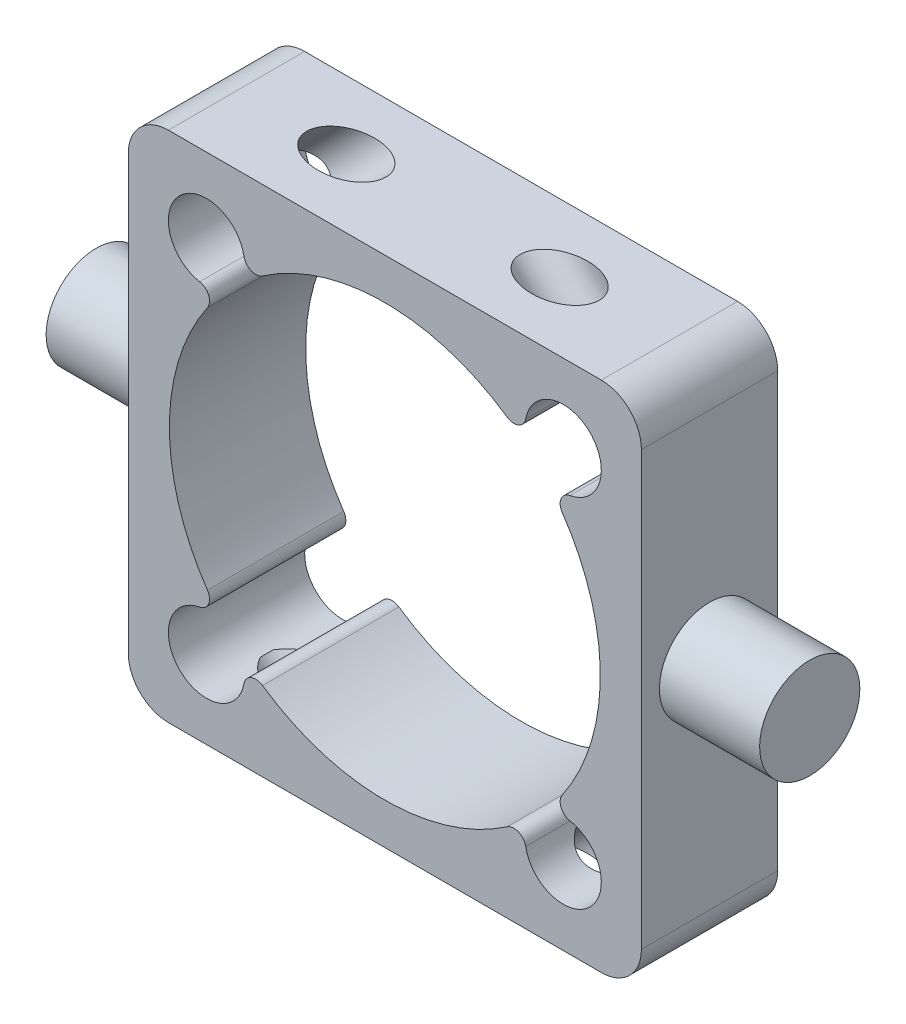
from build123d import *

# Parameters (mm, degrees)
ESBO_O1_W                 = 128
ESBO_O1_H                 = 128
EXTRUS_O1_DEPTH           = 34
ESBO_O2_R                 = 12.5
EXTRUS_O2_DEPTH           = 25
FILETE2_R                 = 10
ESBO_O6_R                 = 7
EXTRUS_O5_DEPTH           = 42
ESPELHAR3_COPY_1_SKETCH_R = 7
ESPELHAR3_COPY_1_DEPTH    = 42


with BuildPart() as part:
    # Esbo_o1 → Extrus_o1 (new body)
    with BuildSketch(Plane.XY):
        Rectangle(ESBO_O1_W, ESBO_O1_H)
        with BuildLine():
            ThreePointArc((-44.259654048, 30.498287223), (-53.75, 0), (-44.259654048, -30.498287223))
            ThreePointArc((-44.259654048, -30.498287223), (-43.959865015, -33.352286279), (-46.194769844, -35.152393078))
            ThreePointArc((-46.194769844, -35.152393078), (-51.217514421, -51.217514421), (-35.152393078, -46.194769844))
            ThreePointArc((-35.152393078, -46.194769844), (-33.352286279, -43.959865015), (-30.498287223, -44.259654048))
            ThreePointArc((-30.498287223, -44.259654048), (0, -53.75), (30.498287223, -44.259654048))
            ThreePointArc((30.498287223, -44.259654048), (33.352286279, -43.959865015), (35.152393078, -46.194769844))
            ThreePointArc((35.152393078, -46.194769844), (51.217514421, -51.217514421), (46.194769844, -35.152393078))
            ThreePointArc((46.194769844, -35.152393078), (43.959865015, -33.352286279), (44.259654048, -30.498287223))
            ThreePointArc((44.259654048, -30.498287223), (53.75, 0), (44.259654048, 30.498287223))
            ThreePointArc((44.259654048, 30.498287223), (43.959865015, 33.352286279), (46.194769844, 35.152393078))
            ThreePointArc((46.194769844, 35.152393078), (51.217514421, 51.217514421), (35.152393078, 46.194769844))
            ThreePointArc((35.152393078, 46.194769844), (33.352286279, 43.959865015), (30.498287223, 44.259654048))
            ThreePointArc((30.498287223, 44.259654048), (0, 53.75), (-30.498287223, 44.259654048))
            ThreePointArc((-30.498287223, 44.259654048), (-33.352286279, 43.959865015), (-35.152393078, 46.194769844))
            ThreePointArc((-35.152393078, 46.194769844), (-51.217514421, 51.217514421), (-46.194769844, 35.152393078))
            ThreePointArc((-46.194769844, 35.152393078), (-43.959865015, 33.352286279), (-44.259654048, 30.498287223))
        make_face(mode=Mode.SUBTRACT)
    extrude(amount=EXTRUS_O1_DEPTH)

    # Esbo_o2 → Extrus_o2 (add)
    with BuildSketch(Plane.ZY.offset(64)):
        with Locations(Location((17, 0, 0), (0, 0, 180))):
            Circle(ESBO_O2_R)
    extrus_o2 = extrude(amount=EXTRUS_O2_DEPTH)

    # Espelhar1: Extrus_o2 across plane
    add(extrus_o2.mirror(Plane(origin=(0, 0, 0), x_dir=(0, 0, 1), z_dir=(1, 0, 0))))

    # Filete2
    filete2_edges = [part.edges().sort_by_distance(p)[0] for p in [
        (-64, 64, 17),
        (64, 64, 17),
        (64, -64, 17),
        (-64, -64, 17),
    ]]
    fillet(filete2_edges, radius=FILETE2_R)

    # Esbo_o6 → Extrus_o5 (cut)
    with BuildSketch(Plane(origin=(-33.369684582, 33.369684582, 0), x_dir=(0.7071067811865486, 0.7071067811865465, 0), z_dir=(0.7071067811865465, -0.7071067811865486, 0))):
        with Locations(Location((64.071067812, 17, 0), (0, 0, 180))):
            Circle(ESBO_O6_R)
    extrus_o5 = extrude(amount=EXTRUS_O5_DEPTH, mode=Mode.SUBTRACT)

    # Espelhar2: Extrus_o5 across plane
    add(extrus_o5.mirror(Plane(origin=(0, 0, 0), x_dir=(0, 0, 1), z_dir=(1, 0, 0))), mode=Mode.SUBTRACT)

    # Espelhar3: Extrus_o5 across plane
    add(extrus_o5.mirror(Plane.ZX), mode=Mode.SUBTRACT)

    # Espelhar3 copy 1 sketch → Espelhar3 copy 1 (cut)
    with BuildSketch(Plane(origin=(33.369684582, -33.369684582, 0), x_dir=(-0.707106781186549, -0.707106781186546, 0), z_dir=(-0.707106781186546, 0.707106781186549, 0))):
        with Locations(Location((64.071067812, 17, 0), (0, 0, 180))):
            Circle(ESPELHAR3_COPY_1_SKETCH_R)
    extrude(amount=ESPELHAR3_COPY_1_DEPTH, mode=Mode.SUBTRACT)


solid = part.part
